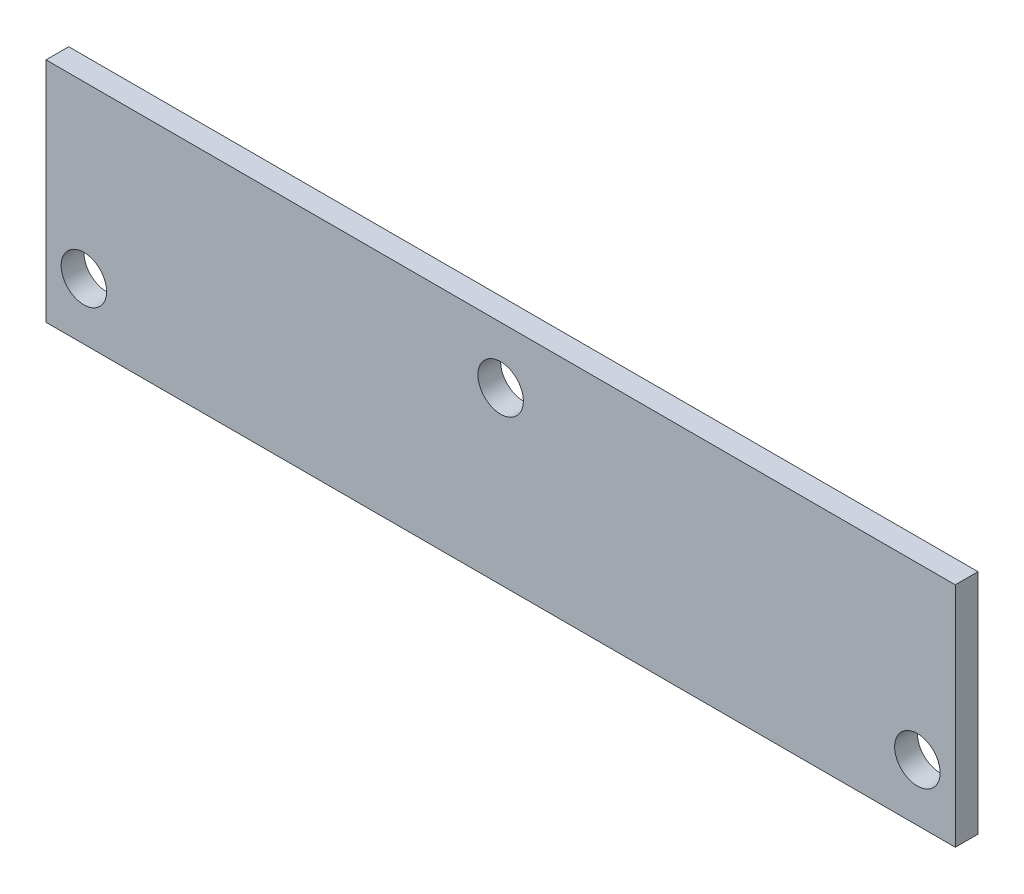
ISO-10303-21;
HEADER;
FILE_DESCRIPTION(('STEP AP214'),'2;1');
FILE_NAME('part.step','',(''),(''),'','','');
FILE_SCHEMA(('AUTOMOTIVE_DESIGN { 1 0 10303 214 1 1 1 1 }'));
ENDSEC;
DATA;
#1=APPLICATION_CONTEXT('core data for automotive mechanical design processes');
#2=APPLICATION_PROTOCOL_DEFINITION('international standard','automotive_design',2000,#1);
#3=PRODUCT_CONTEXT('',#1,'mechanical');
#4=PRODUCT('Part','Part','',(#3));
#5=PRODUCT_RELATED_PRODUCT_CATEGORY('part','',(#4));
#6=PRODUCT_DEFINITION_FORMATION('','',#4);
#7=PRODUCT_DEFINITION_CONTEXT('part definition',#1,'design');
#8=PRODUCT_DEFINITION('design','',#6,#7);
#9=PRODUCT_DEFINITION_SHAPE('','',#8);
#10=(LENGTH_UNIT() NAMED_UNIT(*) SI_UNIT(.MILLI.,.METRE.));
#11=(NAMED_UNIT(*) PLANE_ANGLE_UNIT() SI_UNIT($,.RADIAN.));
#12=(NAMED_UNIT(*) SI_UNIT($,.STERADIAN.) SOLID_ANGLE_UNIT());
#13=UNCERTAINTY_MEASURE_WITH_UNIT(LENGTH_MEASURE(1.E-05),#10,'distance_accuracy_value','');
#14=(GEOMETRIC_REPRESENTATION_CONTEXT(3) GLOBAL_UNCERTAINTY_ASSIGNED_CONTEXT((#13)) GLOBAL_UNIT_ASSIGNED_CONTEXT((#10,
#11,#12)) REPRESENTATION_CONTEXT('',''));
#15=CARTESIAN_POINT('',(0.,0.,0.));
#16=DIRECTION('',(0.,0.,1.));
#17=DIRECTION('',(1.,0.,0.));
#18=AXIS2_PLACEMENT_3D('',#15,#16,#17);
#19=CARTESIAN_POINT('',(0.,0.,3.));
#20=DIRECTION('',(1.,0.,0.));
#21=DIRECTION('',(0.,0.,-1.));
#22=AXIS2_PLACEMENT_3D('',#19,#20,#21);
#23=PLANE('',#22);
#24=DIRECTION('',(0.,-1.,0.));
#25=VECTOR('',#24,1.);
#26=CARTESIAN_POINT('',(0.,0.,0.));
#27=LINE('',#26,#25);
#28=CARTESIAN_POINT('',(0.,30.,0.));
#29=VERTEX_POINT('',#28);
#30=CARTESIAN_POINT('',(0.,0.,0.));
#31=VERTEX_POINT('',#30);
#32=EDGE_CURVE('E110',#29,#31,#27,.T.);
#33=ORIENTED_EDGE('',*,*,#32,.T.);
#34=DIRECTION('',(0.,0.,-1.));
#35=VECTOR('',#34,1.);
#36=CARTESIAN_POINT('',(0.,0.,3.));
#37=LINE('',#36,#35);
#38=CARTESIAN_POINT('',(0.,0.,3.));
#39=VERTEX_POINT('',#38);
#40=EDGE_CURVE('E11',#39,#31,#37,.T.);
#41=ORIENTED_EDGE('',*,*,#40,.F.);
#42=DIRECTION('',(0.,-1.,0.));
#43=VECTOR('',#42,1.);
#44=CARTESIAN_POINT('',(0.,0.,3.));
#45=LINE('',#44,#43);
#46=CARTESIAN_POINT('',(0.,30.,3.));
#47=VERTEX_POINT('',#46);
#48=EDGE_CURVE('E93',#47,#39,#45,.T.);
#49=ORIENTED_EDGE('',*,*,#48,.F.);
#50=DIRECTION('',(0.,0.,-1.));
#51=VECTOR('',#50,1.);
#52=CARTESIAN_POINT('',(0.,30.,3.));
#53=LINE('',#52,#51);
#54=EDGE_CURVE('E106',#47,#29,#53,.T.);
#55=ORIENTED_EDGE('',*,*,#54,.T.);
#56=EDGE_LOOP('',(#33,#41,#49,#55));
#57=FACE_BOUND('',#56,.T.);
#58=ADVANCED_FACE('F39',(#57),#23,.F.);
#59=CARTESIAN_POINT('',(0.,0.,3.));
#60=DIRECTION('',(0.,1.,0.));
#61=DIRECTION('',(0.,0.,1.));
#62=AXIS2_PLACEMENT_3D('',#59,#60,#61);
#63=PLANE('',#62);
#64=DIRECTION('',(1.,0.,0.));
#65=VECTOR('',#64,1.);
#66=CARTESIAN_POINT('',(0.,0.,0.));
#67=LINE('',#66,#65);
#68=CARTESIAN_POINT('',(120.,0.,0.));
#69=VERTEX_POINT('',#68);
#70=EDGE_CURVE('E98',#31,#69,#67,.T.);
#71=ORIENTED_EDGE('',*,*,#70,.T.);
#72=DIRECTION('',(0.,0.,-1.));
#73=VECTOR('',#72,1.);
#74=CARTESIAN_POINT('',(120.,0.,3.));
#75=LINE('',#74,#73);
#76=CARTESIAN_POINT('',(120.,0.,3.));
#77=VERTEX_POINT('',#76);
#78=EDGE_CURVE('E49',#77,#69,#75,.T.);
#79=ORIENTED_EDGE('',*,*,#78,.F.);
#80=DIRECTION('',(1.,0.,0.));
#81=VECTOR('',#80,1.);
#82=CARTESIAN_POINT('',(0.,0.,3.));
#83=LINE('',#82,#81);
#84=EDGE_CURVE('E88',#39,#77,#83,.T.);
#85=ORIENTED_EDGE('',*,*,#84,.F.);
#86=ORIENTED_EDGE('',*,*,#40,.T.);
#87=EDGE_LOOP('',(#71,#79,#85,#86));
#88=FACE_BOUND('',#87,.T.);
#89=ADVANCED_FACE('F97',(#88),#63,.F.);
#90=CARTESIAN_POINT('',(120.,0.,3.));
#91=DIRECTION('',(-1.,0.,0.));
#92=DIRECTION('',(0.,0.,1.));
#93=AXIS2_PLACEMENT_3D('',#90,#91,#92);
#94=PLANE('',#93);
#95=DIRECTION('',(0.,1.,0.));
#96=VECTOR('',#95,1.);
#97=CARTESIAN_POINT('',(120.,0.,0.));
#98=LINE('',#97,#96);
#99=CARTESIAN_POINT('',(120.,30.,0.));
#100=VERTEX_POINT('',#99);
#101=EDGE_CURVE('E75',#69,#100,#98,.T.);
#102=ORIENTED_EDGE('',*,*,#101,.T.);
#103=DIRECTION('',(0.,0.,-1.));
#104=VECTOR('',#103,1.);
#105=CARTESIAN_POINT('',(120.,30.,3.));
#106=LINE('',#105,#104);
#107=CARTESIAN_POINT('',(120.,30.,3.));
#108=VERTEX_POINT('',#107);
#109=EDGE_CURVE('E100',#108,#100,#106,.T.);
#110=ORIENTED_EDGE('',*,*,#109,.F.);
#111=DIRECTION('',(0.,1.,0.));
#112=VECTOR('',#111,1.);
#113=CARTESIAN_POINT('',(120.,0.,3.));
#114=LINE('',#113,#112);
#115=EDGE_CURVE('E91',#77,#108,#114,.T.);
#116=ORIENTED_EDGE('',*,*,#115,.F.);
#117=ORIENTED_EDGE('',*,*,#78,.T.);
#118=EDGE_LOOP('',(#102,#110,#116,#117));
#119=FACE_BOUND('',#118,.T.);
#120=ADVANCED_FACE('F102',(#119),#94,.F.);
#121=CARTESIAN_POINT('',(0.,30.,3.));
#122=DIRECTION('',(0.,-1.,0.));
#123=DIRECTION('',(0.,0.,-1.));
#124=AXIS2_PLACEMENT_3D('',#121,#122,#123);
#125=PLANE('',#124);
#126=DIRECTION('',(-1.,0.,0.));
#127=VECTOR('',#126,1.);
#128=CARTESIAN_POINT('',(0.,30.,0.));
#129=LINE('',#128,#127);
#130=EDGE_CURVE('E81',#100,#29,#129,.T.);
#131=ORIENTED_EDGE('',*,*,#130,.T.);
#132=ORIENTED_EDGE('',*,*,#54,.F.);
#133=DIRECTION('',(-1.,0.,0.));
#134=VECTOR('',#133,1.);
#135=CARTESIAN_POINT('',(0.,30.,3.));
#136=LINE('',#135,#134);
#137=EDGE_CURVE('E58',#108,#47,#136,.T.);
#138=ORIENTED_EDGE('',*,*,#137,.F.);
#139=ORIENTED_EDGE('',*,*,#109,.T.);
#140=EDGE_LOOP('',(#131,#132,#138,#139));
#141=FACE_BOUND('',#140,.T.);
#142=ADVANCED_FACE('F150',(#141),#125,.F.);
#143=CARTESIAN_POINT('',(0.,0.,3.));
#144=DIRECTION('',(0.,0.,-1.));
#145=DIRECTION('',(-1.,0.,0.));
#146=AXIS2_PLACEMENT_3D('',#143,#144,#145);
#147=PLANE('',#146);
#148=CARTESIAN_POINT('',(60.,22.5,3.));
#149=DIRECTION('',(0.,0.,1.));
#150=DIRECTION('',(1.,0.,0.));
#151=AXIS2_PLACEMENT_3D('',#148,#149,#150);
#152=CIRCLE('',#151,3.00000000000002);
#153=CARTESIAN_POINT('',(63.,22.5,3.));
#154=VERTEX_POINT('',#153);
#155=EDGE_CURVE('E128',#154,#154,#152,.T.);
#156=ORIENTED_EDGE('',*,*,#155,.F.);
#157=EDGE_LOOP('',(#156));
#158=FACE_BOUND('',#157,.T.);
#159=CARTESIAN_POINT('',(115.,7.49999999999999,3.));
#160=DIRECTION('',(0.,0.,1.));
#161=DIRECTION('',(1.,0.,0.));
#162=AXIS2_PLACEMENT_3D('',#159,#160,#161);
#163=CIRCLE('',#162,2.99999999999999);
#164=CARTESIAN_POINT('',(118.,7.49999999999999,3.));
#165=VERTEX_POINT('',#164);
#166=EDGE_CURVE('E219',#165,#165,#163,.T.);
#167=ORIENTED_EDGE('',*,*,#166,.F.);
#168=EDGE_LOOP('',(#167));
#169=FACE_BOUND('',#168,.T.);
#170=CARTESIAN_POINT('',(5.,7.49999999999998,3.));
#171=DIRECTION('',(0.,0.,1.));
#172=DIRECTION('',(-1.,0.,0.));
#173=AXIS2_PLACEMENT_3D('',#170,#171,#172);
#174=CIRCLE('',#173,3.);
#175=CARTESIAN_POINT('',(2.00000000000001,7.49999999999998,3.));
#176=VERTEX_POINT('',#175);
#177=EDGE_CURVE('E222',#176,#176,#174,.T.);
#178=ORIENTED_EDGE('',*,*,#177,.F.);
#179=EDGE_LOOP('',(#178));
#180=FACE_BOUND('',#179,.T.);
#181=ORIENTED_EDGE('',*,*,#48,.T.);
#182=ORIENTED_EDGE('',*,*,#84,.T.);
#183=ORIENTED_EDGE('',*,*,#115,.T.);
#184=ORIENTED_EDGE('',*,*,#137,.T.);
#185=EDGE_LOOP('',(#181,#182,#183,#184));
#186=FACE_BOUND('',#185,.T.);
#187=ADVANCED_FACE('F89',(#158,#169,#180,#186),#147,.F.);
#188=CARTESIAN_POINT('',(0.,0.,0.));
#189=DIRECTION('',(0.,0.,-1.));
#190=DIRECTION('',(-1.,0.,0.));
#191=AXIS2_PLACEMENT_3D('',#188,#189,#190);
#192=PLANE('',#191);
#193=CARTESIAN_POINT('',(60.,22.5,0.));
#194=DIRECTION('',(0.,0.,-1.));
#195=DIRECTION('',(-1.,0.,0.));
#196=AXIS2_PLACEMENT_3D('',#193,#194,#195);
#197=CIRCLE('',#196,3.00000000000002);
#198=CARTESIAN_POINT('',(57.,22.5,0.));
#199=VERTEX_POINT('',#198);
#200=EDGE_CURVE('E42',#199,#199,#197,.T.);
#201=ORIENTED_EDGE('',*,*,#200,.F.);
#202=EDGE_LOOP('',(#201));
#203=FACE_BOUND('',#202,.T.);
#204=CARTESIAN_POINT('',(115.,7.49999999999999,0.));
#205=DIRECTION('',(0.,0.,-1.));
#206=DIRECTION('',(-1.,0.,0.));
#207=AXIS2_PLACEMENT_3D('',#204,#205,#206);
#208=CIRCLE('',#207,2.99999999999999);
#209=CARTESIAN_POINT('',(112.,7.49999999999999,0.));
#210=VERTEX_POINT('',#209);
#211=EDGE_CURVE('E127',#210,#210,#208,.T.);
#212=ORIENTED_EDGE('',*,*,#211,.F.);
#213=EDGE_LOOP('',(#212));
#214=FACE_BOUND('',#213,.T.);
#215=CARTESIAN_POINT('',(5.,7.49999999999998,0.));
#216=DIRECTION('',(0.,0.,-1.));
#217=DIRECTION('',(-1.,0.,0.));
#218=AXIS2_PLACEMENT_3D('',#215,#216,#217);
#219=CIRCLE('',#218,3.);
#220=CARTESIAN_POINT('',(2.00000000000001,7.49999999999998,0.));
#221=VERTEX_POINT('',#220);
#222=EDGE_CURVE('E124',#221,#221,#219,.T.);
#223=ORIENTED_EDGE('',*,*,#222,.F.);
#224=EDGE_LOOP('',(#223));
#225=FACE_BOUND('',#224,.T.);
#226=ORIENTED_EDGE('',*,*,#32,.F.);
#227=ORIENTED_EDGE('',*,*,#130,.F.);
#228=ORIENTED_EDGE('',*,*,#101,.F.);
#229=ORIENTED_EDGE('',*,*,#70,.F.);
#230=EDGE_LOOP('',(#226,#227,#228,#229));
#231=FACE_BOUND('',#230,.T.);
#232=ADVANCED_FACE('F140',(#203,#214,#225,#231),#192,.T.);
#233=CARTESIAN_POINT('',(5.,7.49999999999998,-3.));
#234=DIRECTION('',(0.,0.,1.));
#235=DIRECTION('',(1.,0.,0.));
#236=AXIS2_PLACEMENT_3D('',#233,#234,#235);
#237=CYLINDRICAL_SURFACE('',#236,3.);
#238=ORIENTED_EDGE('',*,*,#222,.T.);
#239=EDGE_LOOP('',(#238));
#240=FACE_BOUND('',#239,.T.);
#241=ORIENTED_EDGE('',*,*,#177,.T.);
#242=EDGE_LOOP('',(#241));
#243=FACE_BOUND('',#242,.T.);
#244=ADVANCED_FACE('F143',(#240,#243),#237,.F.);
#245=CARTESIAN_POINT('',(115.,7.49999999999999,-3.));
#246=DIRECTION('',(0.,0.,1.));
#247=DIRECTION('',(1.,0.,0.));
#248=AXIS2_PLACEMENT_3D('',#245,#246,#247);
#249=CYLINDRICAL_SURFACE('',#248,2.99999999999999);
#250=ORIENTED_EDGE('',*,*,#211,.T.);
#251=EDGE_LOOP('',(#250));
#252=FACE_BOUND('',#251,.T.);
#253=ORIENTED_EDGE('',*,*,#166,.T.);
#254=EDGE_LOOP('',(#253));
#255=FACE_BOUND('',#254,.T.);
#256=ADVANCED_FACE('F195',(#252,#255),#249,.F.);
#257=CARTESIAN_POINT('',(60.,22.5,-3.));
#258=DIRECTION('',(0.,0.,1.));
#259=DIRECTION('',(1.,0.,0.));
#260=AXIS2_PLACEMENT_3D('',#257,#258,#259);
#261=CYLINDRICAL_SURFACE('',#260,3.00000000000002);
#262=ORIENTED_EDGE('',*,*,#200,.T.);
#263=EDGE_LOOP('',(#262));
#264=FACE_BOUND('',#263,.T.);
#265=ORIENTED_EDGE('',*,*,#155,.T.);
#266=EDGE_LOOP('',(#265));
#267=FACE_BOUND('',#266,.T.);
#268=ADVANCED_FACE('F137',(#264,#267),#261,.F.);
#269=CLOSED_SHELL('',(#58,#89,#120,#142,#187,#232,#244,#256,#268));
#270=MANIFOLD_SOLID_BREP('B2',#269);
#271=ADVANCED_BREP_SHAPE_REPRESENTATION('',(#18,#270),#14);
#272=SHAPE_DEFINITION_REPRESENTATION(#9,#271);
ENDSEC;
END-ISO-10303-21;
